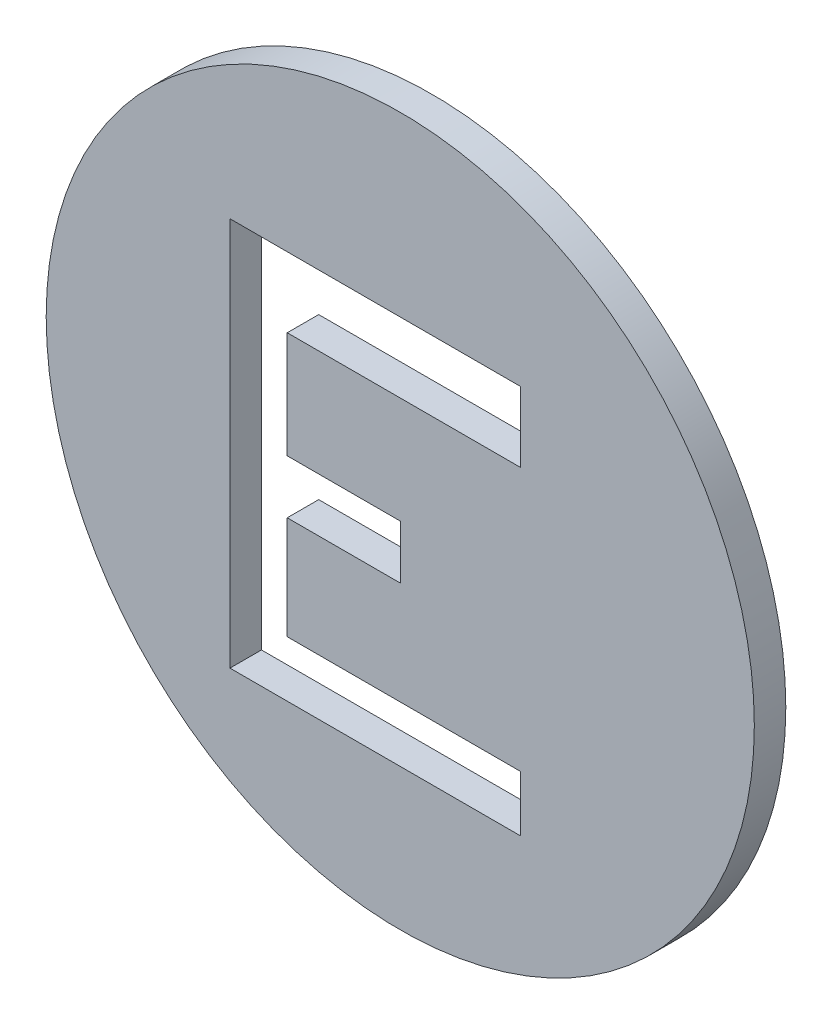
ISO-10303-21;
HEADER;
FILE_DESCRIPTION(('STEP AP214'),'2;1');
FILE_NAME('part.step','',(''),(''),'','','');
FILE_SCHEMA(('AUTOMOTIVE_DESIGN { 1 0 10303 214 1 1 1 1 }'));
ENDSEC;
DATA;
#1=APPLICATION_CONTEXT('core data for automotive mechanical design processes');
#2=APPLICATION_PROTOCOL_DEFINITION('international standard','automotive_design',2000,#1);
#3=PRODUCT_CONTEXT('',#1,'mechanical');
#4=PRODUCT('Part','Part','',(#3));
#5=PRODUCT_RELATED_PRODUCT_CATEGORY('part','',(#4));
#6=PRODUCT_DEFINITION_FORMATION('','',#4);
#7=PRODUCT_DEFINITION_CONTEXT('part definition',#1,'design');
#8=PRODUCT_DEFINITION('design','',#6,#7);
#9=PRODUCT_DEFINITION_SHAPE('','',#8);
#10=(LENGTH_UNIT() NAMED_UNIT(*) SI_UNIT(.MILLI.,.METRE.));
#11=(NAMED_UNIT(*) PLANE_ANGLE_UNIT() SI_UNIT($,.RADIAN.));
#12=(NAMED_UNIT(*) SI_UNIT($,.STERADIAN.) SOLID_ANGLE_UNIT());
#13=UNCERTAINTY_MEASURE_WITH_UNIT(LENGTH_MEASURE(1.E-05),#10,'distance_accuracy_value','');
#14=(GEOMETRIC_REPRESENTATION_CONTEXT(3) GLOBAL_UNCERTAINTY_ASSIGNED_CONTEXT((#13)) GLOBAL_UNIT_ASSIGNED_CONTEXT((#10,
#11,#12)) REPRESENTATION_CONTEXT('',''));
#15=CARTESIAN_POINT('',(0.,0.,0.));
#16=DIRECTION('',(0.,0.,1.));
#17=DIRECTION('',(1.,0.,0.));
#18=AXIS2_PLACEMENT_3D('',#15,#16,#17);
#19=CARTESIAN_POINT('',(0.,0.,4.));
#20=DIRECTION('',(0.,0.,-1.));
#21=DIRECTION('',(-1.,0.,0.));
#22=AXIS2_PLACEMENT_3D('',#19,#20,#21);
#23=CYLINDRICAL_SURFACE('',#22,45.);
#24=CARTESIAN_POINT('',(0.,0.,4.));
#25=DIRECTION('',(0.,0.,1.));
#26=DIRECTION('',(1.,0.,0.));
#27=AXIS2_PLACEMENT_3D('',#24,#25,#26);
#28=CIRCLE('',#27,45.);
#29=CARTESIAN_POINT('',(45.,0.,4.));
#30=VERTEX_POINT('',#29);
#31=EDGE_CURVE('E11',#30,#30,#28,.T.);
#32=ORIENTED_EDGE('',*,*,#31,.F.);
#33=EDGE_LOOP('',(#32));
#34=FACE_BOUND('',#33,.T.);
#35=CARTESIAN_POINT('',(0.,0.,0.));
#36=DIRECTION('',(0.,0.,1.));
#37=DIRECTION('',(1.,0.,0.));
#38=AXIS2_PLACEMENT_3D('',#35,#36,#37);
#39=CIRCLE('',#38,45.);
#40=CARTESIAN_POINT('',(45.,0.,0.));
#41=VERTEX_POINT('',#40);
#42=EDGE_CURVE('E36',#41,#41,#39,.T.);
#43=ORIENTED_EDGE('',*,*,#42,.T.);
#44=EDGE_LOOP('',(#43));
#45=FACE_BOUND('',#44,.T.);
#46=ADVANCED_FACE('F33',(#34,#45),#23,.T.);
#47=CARTESIAN_POINT('',(0.,0.,4.));
#48=DIRECTION('',(0.,0.,1.));
#49=DIRECTION('',(1.,0.,0.));
#50=AXIS2_PLACEMENT_3D('',#47,#48,#49);
#51=PLANE('',#50);
#52=DIRECTION('',(0.,1.,0.));
#53=VECTOR('',#52,1.);
#54=CARTESIAN_POINT('',(15.2749067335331,22.4577497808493,4.));
#55=LINE('',#54,#53);
#56=CARTESIAN_POINT('',(15.2749067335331,13.5473875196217,4.));
#57=VERTEX_POINT('',#56);
#58=CARTESIAN_POINT('',(15.2749067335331,22.4577497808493,4.));
#59=VERTEX_POINT('',#58);
#60=EDGE_CURVE('E47',#57,#59,#55,.T.);
#61=ORIENTED_EDGE('',*,*,#60,.F.);
#62=DIRECTION('',(1.,0.,0.));
#63=VECTOR('',#62,1.);
#64=CARTESIAN_POINT('',(15.2749067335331,13.5473875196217,4.));
#65=LINE('',#64,#63);
#66=CARTESIAN_POINT('',(-14.3656860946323,13.5473875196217,4.));
#67=VERTEX_POINT('',#66);
#68=EDGE_CURVE('E140',#67,#57,#65,.T.);
#69=ORIENTED_EDGE('',*,*,#68,.F.);
#70=DIRECTION('',(0.,1.,0.));
#71=VECTOR('',#70,1.);
#72=CARTESIAN_POINT('',(-14.3656860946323,13.5473875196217,4.));
#73=LINE('',#72,#71);
#74=CARTESIAN_POINT('',(-14.3656860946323,0.,4.));
#75=VERTEX_POINT('',#74);
#76=EDGE_CURVE('E143',#75,#67,#73,.T.);
#77=ORIENTED_EDGE('',*,*,#76,.F.);
#78=DIRECTION('',(-1.,0.,0.));
#79=VECTOR('',#78,1.);
#80=CARTESIAN_POINT('',(-14.3656860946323,0.,4.));
#81=LINE('',#80,#79);
#82=CARTESIAN_POINT('',(0.,0.,4.));
#83=VERTEX_POINT('',#82);
#84=EDGE_CURVE('E195',#83,#75,#81,.T.);
#85=ORIENTED_EDGE('',*,*,#84,.F.);
#86=DIRECTION('',(0.,1.,0.));
#87=VECTOR('',#86,1.);
#88=CARTESIAN_POINT('',(0.,0.,4.));
#89=LINE('',#88,#87);
#90=CARTESIAN_POINT('',(0.,-6.81915479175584,4.));
#91=VERTEX_POINT('',#90);
#92=EDGE_CURVE('E192',#91,#83,#89,.T.);
#93=ORIENTED_EDGE('',*,*,#92,.F.);
#94=DIRECTION('',(1.,0.,0.));
#95=VECTOR('',#94,1.);
#96=CARTESIAN_POINT('',(0.,-6.81915479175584,4.));
#97=LINE('',#96,#95);
#98=CARTESIAN_POINT('',(-14.3656860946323,-6.81915479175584,4.));
#99=VERTEX_POINT('',#98);
#100=EDGE_CURVE('E189',#99,#91,#97,.T.);
#101=ORIENTED_EDGE('',*,*,#100,.F.);
#102=DIRECTION('',(0.,1.,0.));
#103=VECTOR('',#102,1.);
#104=CARTESIAN_POINT('',(-14.3656860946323,-6.81915479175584,4.));
#105=LINE('',#104,#103);
#106=CARTESIAN_POINT('',(-14.3656860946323,-19.9119319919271,4.));
#107=VERTEX_POINT('',#106);
#108=EDGE_CURVE('E186',#107,#99,#105,.T.);
#109=ORIENTED_EDGE('',*,*,#108,.F.);
#110=DIRECTION('',(-1.,0.,0.));
#111=VECTOR('',#110,1.);
#112=CARTESIAN_POINT('',(-14.3656860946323,-19.9119319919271,4.));
#113=LINE('',#112,#111);
#114=CARTESIAN_POINT('',(15.2749067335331,-19.9119319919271,4.));
#115=VERTEX_POINT('',#114);
#116=EDGE_CURVE('E183',#115,#107,#113,.T.);
#117=ORIENTED_EDGE('',*,*,#116,.F.);
#118=DIRECTION('',(0.,1.,0.));
#119=VECTOR('',#118,1.);
#120=CARTESIAN_POINT('',(15.2749067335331,-19.9119319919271,4.));
#121=LINE('',#120,#119);
#122=CARTESIAN_POINT('',(15.2749067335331,-27.0038529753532,4.));
#123=VERTEX_POINT('',#122);
#124=EDGE_CURVE('E180',#123,#115,#121,.T.);
#125=ORIENTED_EDGE('',*,*,#124,.F.);
#126=DIRECTION('',(1.,0.,0.));
#127=VECTOR('',#126,1.);
#128=CARTESIAN_POINT('',(-21.6394512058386,-27.0038529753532,4.));
#129=LINE('',#128,#127);
#130=CARTESIAN_POINT('',(-21.6394512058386,-27.0038529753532,4.));
#131=VERTEX_POINT('',#130);
#132=EDGE_CURVE('E177',#131,#123,#129,.T.);
#133=ORIENTED_EDGE('',*,*,#132,.F.);
#134=DIRECTION('',(0.,-1.,0.));
#135=VECTOR('',#134,1.);
#136=CARTESIAN_POINT('',(-21.6394512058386,22.4577497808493,4.));
#137=LINE('',#136,#135);
#138=CARTESIAN_POINT('',(-21.6394512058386,22.4577497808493,4.));
#139=VERTEX_POINT('',#138);
#140=EDGE_CURVE('E174',#139,#131,#137,.T.);
#141=ORIENTED_EDGE('',*,*,#140,.F.);
#142=DIRECTION('',(-1.,0.,0.));
#143=VECTOR('',#142,1.);
#144=CARTESIAN_POINT('',(15.2749067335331,22.4577497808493,4.));
#145=LINE('',#144,#143);
#146=EDGE_CURVE('E172',#59,#139,#145,.T.);
#147=ORIENTED_EDGE('',*,*,#146,.F.);
#148=EDGE_LOOP('',(#61,#69,#77,#85,#93,#101,#109,#117,#125,#133,#141,#147));
#149=FACE_BOUND('',#148,.T.);
#150=ORIENTED_EDGE('',*,*,#31,.T.);
#151=EDGE_LOOP('',(#150));
#152=FACE_BOUND('',#151,.T.);
#153=ADVANCED_FACE('F224',(#149,#152),#51,.T.);
#154=CARTESIAN_POINT('',(0.,0.,0.));
#155=DIRECTION('',(0.,0.,1.));
#156=DIRECTION('',(1.,0.,0.));
#157=AXIS2_PLACEMENT_3D('',#154,#155,#156);
#158=PLANE('',#157);
#159=DIRECTION('',(1.,0.,0.));
#160=VECTOR('',#159,1.);
#161=CARTESIAN_POINT('',(15.2749067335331,13.5473875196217,0.));
#162=LINE('',#161,#160);
#163=CARTESIAN_POINT('',(-14.3656860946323,13.5473875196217,0.));
#164=VERTEX_POINT('',#163);
#165=CARTESIAN_POINT('',(15.2749067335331,13.5473875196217,0.));
#166=VERTEX_POINT('',#165);
#167=EDGE_CURVE('E129',#164,#166,#162,.T.);
#168=ORIENTED_EDGE('',*,*,#167,.T.);
#169=DIRECTION('',(0.,1.,0.));
#170=VECTOR('',#169,1.);
#171=CARTESIAN_POINT('',(15.2749067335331,22.4577497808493,0.));
#172=LINE('',#171,#170);
#173=CARTESIAN_POINT('',(15.2749067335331,22.4577497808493,0.));
#174=VERTEX_POINT('',#173);
#175=EDGE_CURVE('E123',#166,#174,#172,.T.);
#176=ORIENTED_EDGE('',*,*,#175,.T.);
#177=DIRECTION('',(-1.,0.,0.));
#178=VECTOR('',#177,1.);
#179=CARTESIAN_POINT('',(15.2749067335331,22.4577497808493,0.));
#180=LINE('',#179,#178);
#181=CARTESIAN_POINT('',(-21.6394512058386,22.4577497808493,0.));
#182=VERTEX_POINT('',#181);
#183=EDGE_CURVE('E132',#174,#182,#180,.T.);
#184=ORIENTED_EDGE('',*,*,#183,.T.);
#185=DIRECTION('',(0.,-1.,0.));
#186=VECTOR('',#185,1.);
#187=CARTESIAN_POINT('',(-21.6394512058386,22.4577497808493,0.));
#188=LINE('',#187,#186);
#189=CARTESIAN_POINT('',(-21.6394512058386,-27.0038529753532,0.));
#190=VERTEX_POINT('',#189);
#191=EDGE_CURVE('E55',#182,#190,#188,.T.);
#192=ORIENTED_EDGE('',*,*,#191,.T.);
#193=DIRECTION('',(1.,0.,0.));
#194=VECTOR('',#193,1.);
#195=CARTESIAN_POINT('',(-21.6394512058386,-27.0038529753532,0.));
#196=LINE('',#195,#194);
#197=CARTESIAN_POINT('',(15.2749067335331,-27.0038529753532,0.));
#198=VERTEX_POINT('',#197);
#199=EDGE_CURVE('E147',#190,#198,#196,.T.);
#200=ORIENTED_EDGE('',*,*,#199,.T.);
#201=DIRECTION('',(0.,1.,0.));
#202=VECTOR('',#201,1.);
#203=CARTESIAN_POINT('',(15.2749067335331,-19.9119319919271,0.));
#204=LINE('',#203,#202);
#205=CARTESIAN_POINT('',(15.2749067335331,-19.9119319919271,0.));
#206=VERTEX_POINT('',#205);
#207=EDGE_CURVE('E150',#198,#206,#204,.T.);
#208=ORIENTED_EDGE('',*,*,#207,.T.);
#209=DIRECTION('',(-1.,0.,0.));
#210=VECTOR('',#209,1.);
#211=CARTESIAN_POINT('',(-14.3656860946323,-19.9119319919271,0.));
#212=LINE('',#211,#210);
#213=CARTESIAN_POINT('',(-14.3656860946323,-19.9119319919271,0.));
#214=VERTEX_POINT('',#213);
#215=EDGE_CURVE('E153',#206,#214,#212,.T.);
#216=ORIENTED_EDGE('',*,*,#215,.T.);
#217=DIRECTION('',(0.,1.,0.));
#218=VECTOR('',#217,1.);
#219=CARTESIAN_POINT('',(-14.3656860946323,-6.81915479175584,0.));
#220=LINE('',#219,#218);
#221=CARTESIAN_POINT('',(-14.3656860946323,-6.81915479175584,0.));
#222=VERTEX_POINT('',#221);
#223=EDGE_CURVE('E156',#214,#222,#220,.T.);
#224=ORIENTED_EDGE('',*,*,#223,.T.);
#225=DIRECTION('',(1.,0.,0.));
#226=VECTOR('',#225,1.);
#227=CARTESIAN_POINT('',(0.,-6.81915479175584,0.));
#228=LINE('',#227,#226);
#229=CARTESIAN_POINT('',(0.,-6.81915479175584,0.));
#230=VERTEX_POINT('',#229);
#231=EDGE_CURVE('E159',#222,#230,#228,.T.);
#232=ORIENTED_EDGE('',*,*,#231,.T.);
#233=DIRECTION('',(0.,1.,0.));
#234=VECTOR('',#233,1.);
#235=CARTESIAN_POINT('',(0.,0.,0.));
#236=LINE('',#235,#234);
#237=CARTESIAN_POINT('',(0.,0.,0.));
#238=VERTEX_POINT('',#237);
#239=EDGE_CURVE('E162',#230,#238,#236,.T.);
#240=ORIENTED_EDGE('',*,*,#239,.T.);
#241=DIRECTION('',(-1.,0.,0.));
#242=VECTOR('',#241,1.);
#243=CARTESIAN_POINT('',(-14.3656860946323,0.,0.));
#244=LINE('',#243,#242);
#245=CARTESIAN_POINT('',(-14.3656860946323,0.,0.));
#246=VERTEX_POINT('',#245);
#247=EDGE_CURVE('E165',#238,#246,#244,.T.);
#248=ORIENTED_EDGE('',*,*,#247,.T.);
#249=DIRECTION('',(0.,1.,0.));
#250=VECTOR('',#249,1.);
#251=CARTESIAN_POINT('',(-14.3656860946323,13.5473875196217,0.));
#252=LINE('',#251,#250);
#253=EDGE_CURVE('E168',#246,#164,#252,.T.);
#254=ORIENTED_EDGE('',*,*,#253,.T.);
#255=EDGE_LOOP('',(#168,#176,#184,#192,#200,#208,#216,#224,#232,#240,#248,#254));
#256=FACE_BOUND('',#255,.T.);
#257=ORIENTED_EDGE('',*,*,#42,.F.);
#258=EDGE_LOOP('',(#257));
#259=FACE_BOUND('',#258,.T.);
#260=ADVANCED_FACE('F136',(#256,#259),#158,.F.);
#261=CARTESIAN_POINT('',(15.2749067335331,22.4577497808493,0.));
#262=DIRECTION('',(1.,0.,0.));
#263=DIRECTION('',(0.,0.,-1.));
#264=AXIS2_PLACEMENT_3D('',#261,#262,#263);
#265=PLANE('',#264);
#266=ORIENTED_EDGE('',*,*,#60,.T.);
#267=DIRECTION('',(0.,0.,1.));
#268=VECTOR('',#267,1.);
#269=CARTESIAN_POINT('',(15.2749067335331,22.4577497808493,0.));
#270=LINE('',#269,#268);
#271=EDGE_CURVE('E119',#174,#59,#270,.T.);
#272=ORIENTED_EDGE('',*,*,#271,.F.);
#273=ORIENTED_EDGE('',*,*,#175,.F.);
#274=DIRECTION('',(0.,0.,1.));
#275=VECTOR('',#274,1.);
#276=CARTESIAN_POINT('',(15.2749067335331,13.5473875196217,0.));
#277=LINE('',#276,#275);
#278=EDGE_CURVE('E200',#166,#57,#277,.T.);
#279=ORIENTED_EDGE('',*,*,#278,.T.);
#280=EDGE_LOOP('',(#266,#272,#273,#279));
#281=FACE_BOUND('',#280,.T.);
#282=ADVANCED_FACE('F121',(#281),#265,.F.);
#283=CARTESIAN_POINT('',(15.2749067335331,13.5473875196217,0.));
#284=DIRECTION('',(0.,-1.,0.));
#285=DIRECTION('',(0.,0.,-1.));
#286=AXIS2_PLACEMENT_3D('',#283,#284,#285);
#287=PLANE('',#286);
#288=ORIENTED_EDGE('',*,*,#68,.T.);
#289=ORIENTED_EDGE('',*,*,#278,.F.);
#290=ORIENTED_EDGE('',*,*,#167,.F.);
#291=DIRECTION('',(0.,0.,1.));
#292=VECTOR('',#291,1.);
#293=CARTESIAN_POINT('',(-14.3656860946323,13.5473875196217,0.));
#294=LINE('',#293,#292);
#295=EDGE_CURVE('E202',#164,#67,#294,.T.);
#296=ORIENTED_EDGE('',*,*,#295,.T.);
#297=EDGE_LOOP('',(#288,#289,#290,#296));
#298=FACE_BOUND('',#297,.T.);
#299=ADVANCED_FACE('F259',(#298),#287,.F.);
#300=CARTESIAN_POINT('',(-14.3656860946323,13.5473875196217,0.));
#301=DIRECTION('',(1.,0.,0.));
#302=DIRECTION('',(0.,0.,-1.));
#303=AXIS2_PLACEMENT_3D('',#300,#301,#302);
#304=PLANE('',#303);
#305=ORIENTED_EDGE('',*,*,#76,.T.);
#306=ORIENTED_EDGE('',*,*,#295,.F.);
#307=ORIENTED_EDGE('',*,*,#253,.F.);
#308=DIRECTION('',(0.,0.,1.));
#309=VECTOR('',#308,1.);
#310=CARTESIAN_POINT('',(-14.3656860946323,0.,0.));
#311=LINE('',#310,#309);
#312=EDGE_CURVE('E204',#246,#75,#311,.T.);
#313=ORIENTED_EDGE('',*,*,#312,.T.);
#314=EDGE_LOOP('',(#305,#306,#307,#313));
#315=FACE_BOUND('',#314,.T.);
#316=ADVANCED_FACE('F255',(#315),#304,.F.);
#317=CARTESIAN_POINT('',(-14.3656860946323,0.,0.));
#318=DIRECTION('',(0.,1.,0.));
#319=DIRECTION('',(0.,0.,1.));
#320=AXIS2_PLACEMENT_3D('',#317,#318,#319);
#321=PLANE('',#320);
#322=ORIENTED_EDGE('',*,*,#84,.T.);
#323=ORIENTED_EDGE('',*,*,#312,.F.);
#324=ORIENTED_EDGE('',*,*,#247,.F.);
#325=DIRECTION('',(0.,0.,1.));
#326=VECTOR('',#325,1.);
#327=CARTESIAN_POINT('',(0.,0.,0.));
#328=LINE('',#327,#326);
#329=EDGE_CURVE('E206',#238,#83,#328,.T.);
#330=ORIENTED_EDGE('',*,*,#329,.T.);
#331=EDGE_LOOP('',(#322,#323,#324,#330));
#332=FACE_BOUND('',#331,.T.);
#333=ADVANCED_FACE('F252',(#332),#321,.F.);
#334=CARTESIAN_POINT('',(0.,0.,0.));
#335=DIRECTION('',(1.,0.,0.));
#336=DIRECTION('',(0.,0.,-1.));
#337=AXIS2_PLACEMENT_3D('',#334,#335,#336);
#338=PLANE('',#337);
#339=ORIENTED_EDGE('',*,*,#92,.T.);
#340=ORIENTED_EDGE('',*,*,#329,.F.);
#341=ORIENTED_EDGE('',*,*,#239,.F.);
#342=DIRECTION('',(0.,0.,1.));
#343=VECTOR('',#342,1.);
#344=CARTESIAN_POINT('',(0.,-6.81915479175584,0.));
#345=LINE('',#344,#343);
#346=EDGE_CURVE('E208',#230,#91,#345,.T.);
#347=ORIENTED_EDGE('',*,*,#346,.T.);
#348=EDGE_LOOP('',(#339,#340,#341,#347));
#349=FACE_BOUND('',#348,.T.);
#350=ADVANCED_FACE('F248',(#349),#338,.F.);
#351=CARTESIAN_POINT('',(0.,-6.81915479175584,0.));
#352=DIRECTION('',(0.,-1.,0.));
#353=DIRECTION('',(0.,0.,-1.));
#354=AXIS2_PLACEMENT_3D('',#351,#352,#353);
#355=PLANE('',#354);
#356=ORIENTED_EDGE('',*,*,#100,.T.);
#357=ORIENTED_EDGE('',*,*,#346,.F.);
#358=ORIENTED_EDGE('',*,*,#231,.F.);
#359=DIRECTION('',(0.,0.,1.));
#360=VECTOR('',#359,1.);
#361=CARTESIAN_POINT('',(-14.3656860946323,-6.81915479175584,0.));
#362=LINE('',#361,#360);
#363=EDGE_CURVE('E210',#222,#99,#362,.T.);
#364=ORIENTED_EDGE('',*,*,#363,.T.);
#365=EDGE_LOOP('',(#356,#357,#358,#364));
#366=FACE_BOUND('',#365,.T.);
#367=ADVANCED_FACE('F244',(#366),#355,.F.);
#368=CARTESIAN_POINT('',(-14.3656860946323,-6.81915479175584,0.));
#369=DIRECTION('',(1.,0.,0.));
#370=DIRECTION('',(0.,0.,-1.));
#371=AXIS2_PLACEMENT_3D('',#368,#369,#370);
#372=PLANE('',#371);
#373=ORIENTED_EDGE('',*,*,#108,.T.);
#374=ORIENTED_EDGE('',*,*,#363,.F.);
#375=ORIENTED_EDGE('',*,*,#223,.F.);
#376=DIRECTION('',(0.,0.,1.));
#377=VECTOR('',#376,1.);
#378=CARTESIAN_POINT('',(-14.3656860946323,-19.9119319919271,0.));
#379=LINE('',#378,#377);
#380=EDGE_CURVE('E212',#214,#107,#379,.T.);
#381=ORIENTED_EDGE('',*,*,#380,.T.);
#382=EDGE_LOOP('',(#373,#374,#375,#381));
#383=FACE_BOUND('',#382,.T.);
#384=ADVANCED_FACE('F240',(#383),#372,.F.);
#385=CARTESIAN_POINT('',(-14.3656860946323,-19.9119319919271,0.));
#386=DIRECTION('',(0.,1.,0.));
#387=DIRECTION('',(0.,0.,1.));
#388=AXIS2_PLACEMENT_3D('',#385,#386,#387);
#389=PLANE('',#388);
#390=ORIENTED_EDGE('',*,*,#116,.T.);
#391=ORIENTED_EDGE('',*,*,#380,.F.);
#392=ORIENTED_EDGE('',*,*,#215,.F.);
#393=DIRECTION('',(0.,0.,1.));
#394=VECTOR('',#393,1.);
#395=CARTESIAN_POINT('',(15.2749067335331,-19.9119319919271,0.));
#396=LINE('',#395,#394);
#397=EDGE_CURVE('E214',#206,#115,#396,.T.);
#398=ORIENTED_EDGE('',*,*,#397,.T.);
#399=EDGE_LOOP('',(#390,#391,#392,#398));
#400=FACE_BOUND('',#399,.T.);
#401=ADVANCED_FACE('F236',(#400),#389,.F.);
#402=CARTESIAN_POINT('',(15.2749067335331,-19.9119319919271,0.));
#403=DIRECTION('',(1.,0.,0.));
#404=DIRECTION('',(0.,0.,-1.));
#405=AXIS2_PLACEMENT_3D('',#402,#403,#404);
#406=PLANE('',#405);
#407=ORIENTED_EDGE('',*,*,#124,.T.);
#408=ORIENTED_EDGE('',*,*,#397,.F.);
#409=ORIENTED_EDGE('',*,*,#207,.F.);
#410=DIRECTION('',(0.,0.,1.));
#411=VECTOR('',#410,1.);
#412=CARTESIAN_POINT('',(15.2749067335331,-27.0038529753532,0.));
#413=LINE('',#412,#411);
#414=EDGE_CURVE('E216',#198,#123,#413,.T.);
#415=ORIENTED_EDGE('',*,*,#414,.T.);
#416=EDGE_LOOP('',(#407,#408,#409,#415));
#417=FACE_BOUND('',#416,.T.);
#418=ADVANCED_FACE('F234',(#417),#406,.F.);
#419=CARTESIAN_POINT('',(-21.6394512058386,-27.0038529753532,0.));
#420=DIRECTION('',(0.,-1.,0.));
#421=DIRECTION('',(0.,0.,-1.));
#422=AXIS2_PLACEMENT_3D('',#419,#420,#421);
#423=PLANE('',#422);
#424=ORIENTED_EDGE('',*,*,#132,.T.);
#425=ORIENTED_EDGE('',*,*,#414,.F.);
#426=ORIENTED_EDGE('',*,*,#199,.F.);
#427=DIRECTION('',(0.,0.,1.));
#428=VECTOR('',#427,1.);
#429=CARTESIAN_POINT('',(-21.6394512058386,-27.0038529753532,0.));
#430=LINE('',#429,#428);
#431=EDGE_CURVE('E218',#190,#131,#430,.T.);
#432=ORIENTED_EDGE('',*,*,#431,.T.);
#433=EDGE_LOOP('',(#424,#425,#426,#432));
#434=FACE_BOUND('',#433,.T.);
#435=ADVANCED_FACE('F229',(#434),#423,.F.);
#436=CARTESIAN_POINT('',(-21.6394512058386,22.4577497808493,0.));
#437=DIRECTION('',(-1.,0.,0.));
#438=DIRECTION('',(0.,-1.,0.));
#439=AXIS2_PLACEMENT_3D('',#436,#437,#438);
#440=PLANE('',#439);
#441=ORIENTED_EDGE('',*,*,#140,.T.);
#442=ORIENTED_EDGE('',*,*,#431,.F.);
#443=ORIENTED_EDGE('',*,*,#191,.F.);
#444=DIRECTION('',(0.,0.,1.));
#445=VECTOR('',#444,1.);
#446=CARTESIAN_POINT('',(-21.6394512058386,22.4577497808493,0.));
#447=LINE('',#446,#445);
#448=EDGE_CURVE('E128',#182,#139,#447,.T.);
#449=ORIENTED_EDGE('',*,*,#448,.T.);
#450=EDGE_LOOP('',(#441,#442,#443,#449));
#451=FACE_BOUND('',#450,.T.);
#452=ADVANCED_FACE('F220',(#451),#440,.F.);
#453=CARTESIAN_POINT('',(15.2749067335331,22.4577497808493,0.));
#454=DIRECTION('',(0.,1.,0.));
#455=DIRECTION('',(-1.,0.,0.));
#456=AXIS2_PLACEMENT_3D('',#453,#454,#455);
#457=PLANE('',#456);
#458=ORIENTED_EDGE('',*,*,#146,.T.);
#459=ORIENTED_EDGE('',*,*,#448,.F.);
#460=ORIENTED_EDGE('',*,*,#183,.F.);
#461=ORIENTED_EDGE('',*,*,#271,.T.);
#462=EDGE_LOOP('',(#458,#459,#460,#461));
#463=FACE_BOUND('',#462,.T.);
#464=ADVANCED_FACE('F133',(#463),#457,.F.);
#465=CLOSED_SHELL('',(#46,#153,#260,#282,#299,#316,#333,#350,#367,#384,#401,#418,#435,#452,#464));
#466=MANIFOLD_SOLID_BREP('B2',#465);
#467=ADVANCED_BREP_SHAPE_REPRESENTATION('',(#18,#466),#14);
#468=SHAPE_DEFINITION_REPRESENTATION(#9,#467);
ENDSEC;
END-ISO-10303-21;
